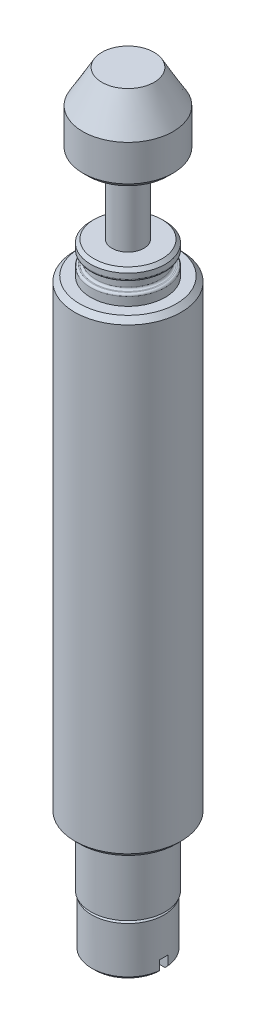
ISO-10303-21;
HEADER;
FILE_DESCRIPTION(('STEP AP214'),'2;1');
FILE_NAME('part.step','',(''),(''),'','','');
FILE_SCHEMA(('AUTOMOTIVE_DESIGN { 1 0 10303 214 1 1 1 1 }'));
ENDSEC;
DATA;
#1=APPLICATION_CONTEXT('core data for automotive mechanical design processes');
#2=APPLICATION_PROTOCOL_DEFINITION('international standard','automotive_design',2000,#1);
#3=PRODUCT_CONTEXT('',#1,'mechanical');
#4=PRODUCT('Part','Part','',(#3));
#5=PRODUCT_RELATED_PRODUCT_CATEGORY('part','',(#4));
#6=PRODUCT_DEFINITION_FORMATION('','',#4);
#7=PRODUCT_DEFINITION_CONTEXT('part definition',#1,'design');
#8=PRODUCT_DEFINITION('design','',#6,#7);
#9=PRODUCT_DEFINITION_SHAPE('','',#8);
#10=(LENGTH_UNIT() NAMED_UNIT(*) SI_UNIT(.MILLI.,.METRE.));
#11=(NAMED_UNIT(*) PLANE_ANGLE_UNIT() SI_UNIT($,.RADIAN.));
#12=(NAMED_UNIT(*) SI_UNIT($,.STERADIAN.) SOLID_ANGLE_UNIT());
#13=UNCERTAINTY_MEASURE_WITH_UNIT(LENGTH_MEASURE(1.E-05),#10,'distance_accuracy_value','');
#14=(GEOMETRIC_REPRESENTATION_CONTEXT(3) GLOBAL_UNCERTAINTY_ASSIGNED_CONTEXT((#13)) GLOBAL_UNIT_ASSIGNED_CONTEXT((#10,
#11,#12)) REPRESENTATION_CONTEXT('',''));
#15=CARTESIAN_POINT('',(0.,0.,0.));
#16=DIRECTION('',(0.,0.,1.));
#17=DIRECTION('',(1.,0.,0.));
#18=AXIS2_PLACEMENT_3D('',#15,#16,#17);
#19=CARTESIAN_POINT('',(0.,72.,0.));
#20=DIRECTION('',(0.,-1.,0.));
#21=DIRECTION('',(0.,0.,-1.));
#22=AXIS2_PLACEMENT_3D('',#19,#20,#21);
#23=PLANE('',#22);
#24=CARTESIAN_POINT('',(0.,72.0000000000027,0.));
#25=DIRECTION('',(0.,-1.,0.));
#26=DIRECTION('',(0.,0.,-1.));
#27=AXIS2_PLACEMENT_3D('',#24,#25,#26);
#28=CIRCLE('',#27,2.45379918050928);
#29=CARTESIAN_POINT('',(0.,72.0000000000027,-2.45379918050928));
#30=VERTEX_POINT('',#29);
#31=EDGE_CURVE('E640',#30,#30,#28,.T.);
#32=ORIENTED_EDGE('',*,*,#31,.F.);
#33=EDGE_LOOP('',(#32));
#34=FACE_BOUND('',#33,.T.);
#35=ADVANCED_FACE('F17',(#34),#23,.F.);
#36=CARTESIAN_POINT('',(0.,68.888888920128,0.));
#37=DIRECTION('',(0.,-1.,0.));
#38=DIRECTION('',(0.,0.,-1.));
#39=AXIS2_PLACEMENT_3D('',#36,#37,#38);
#40=CONICAL_SURFACE('',#39,4.24999999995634,0.523598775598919);
#41=CARTESIAN_POINT('',(0.,68.88888892,0.));
#42=DIRECTION('',(0.,1.,0.));
#43=DIRECTION('',(0.,0.,1.));
#44=AXIS2_PLACEMENT_3D('',#41,#42,#43);
#45=CIRCLE('',#44,4.25);
#46=CARTESIAN_POINT('',(0.,68.88888892,4.25));
#47=VERTEX_POINT('',#46);
#48=EDGE_CURVE('E637',#47,#47,#45,.F.);
#49=ORIENTED_EDGE('',*,*,#48,.F.);
#50=EDGE_LOOP('',(#49));
#51=FACE_BOUND('',#50,.T.);
#52=ORIENTED_EDGE('',*,*,#31,.T.);
#53=EDGE_LOOP('',(#52));
#54=FACE_BOUND('',#53,.T.);
#55=ADVANCED_FACE('F938',(#51,#54),#40,.T.);
#56=CARTESIAN_POINT('',(0.,0.,0.));
#57=DIRECTION('',(0.,1.,0.));
#58=DIRECTION('',(0.,0.,1.));
#59=AXIS2_PLACEMENT_3D('',#56,#57,#58);
#60=CYLINDRICAL_SURFACE('',#59,4.25);
#61=ORIENTED_EDGE('',*,*,#48,.T.);
#62=EDGE_LOOP('',(#61));
#63=FACE_BOUND('',#62,.T.);
#64=CARTESIAN_POINT('',(0.,65.4999999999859,0.));
#65=DIRECTION('',(0.,1.,0.));
#66=DIRECTION('',(0.,0.,1.));
#67=AXIS2_PLACEMENT_3D('',#64,#65,#66);
#68=CIRCLE('',#67,4.25000000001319);
#69=CARTESIAN_POINT('',(0.,65.4999999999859,4.25000000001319));
#70=VERTEX_POINT('',#69);
#71=EDGE_CURVE('E633',#70,#70,#68,.F.);
#72=ORIENTED_EDGE('',*,*,#71,.F.);
#73=EDGE_LOOP('',(#72));
#74=FACE_BOUND('',#73,.T.);
#75=ADVANCED_FACE('F928',(#63,#74),#60,.T.);
#76=CARTESIAN_POINT('',(0.,65.4999999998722,0.));
#77=DIRECTION('',(0.,1.,0.));
#78=DIRECTION('',(0.,0.,1.));
#79=AXIS2_PLACEMENT_3D('',#76,#77,#78);
#80=CONICAL_SURFACE('',#79,4.24999999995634,0.785398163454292);
#81=ORIENTED_EDGE('',*,*,#71,.T.);
#82=EDGE_LOOP('',(#81));
#83=FACE_BOUND('',#82,.T.);
#84=CARTESIAN_POINT('',(0.,64.9999999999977,0.));
#85=DIRECTION('',(0.,1.,0.));
#86=DIRECTION('',(0.,0.,1.));
#87=AXIS2_PLACEMENT_3D('',#84,#85,#86);
#88=CIRCLE('',#87,3.75000000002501);
#89=CARTESIAN_POINT('',(0.,64.9999999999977,3.75000000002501));
#90=VERTEX_POINT('',#89);
#91=EDGE_CURVE('E636',#90,#90,#88,.T.);
#92=ORIENTED_EDGE('',*,*,#91,.T.);
#93=EDGE_LOOP('',(#92));
#94=FACE_BOUND('',#93,.T.);
#95=ADVANCED_FACE('F918',(#83,#94),#80,.T.);
#96=CARTESIAN_POINT('',(3.75,65.,0.));
#97=DIRECTION('',(0.,1.,0.));
#98=DIRECTION('',(0.,0.,1.));
#99=AXIS2_PLACEMENT_3D('',#96,#97,#98);
#100=PLANE('',#99);
#101=CARTESIAN_POINT('',(0.,65.,0.));
#102=DIRECTION('',(0.,1.,0.));
#103=DIRECTION('',(0.,0.,1.));
#104=AXIS2_PLACEMENT_3D('',#101,#102,#103);
#105=CIRCLE('',#104,1.5);
#106=CARTESIAN_POINT('',(0.,65.,1.5));
#107=VERTEX_POINT('',#106);
#108=EDGE_CURVE('E294',#107,#107,#105,.F.);
#109=ORIENTED_EDGE('',*,*,#108,.F.);
#110=EDGE_LOOP('',(#109));
#111=FACE_BOUND('',#110,.T.);
#112=ORIENTED_EDGE('',*,*,#91,.F.);
#113=EDGE_LOOP('',(#112));
#114=FACE_BOUND('',#113,.T.);
#115=ADVANCED_FACE('F908',(#111,#114),#100,.F.);
#116=CARTESIAN_POINT('',(0.,2.5,0.));
#117=DIRECTION('',(0.,1.,0.));
#118=DIRECTION('',(0.,0.,1.));
#119=AXIS2_PLACEMENT_3D('',#116,#117,#118);
#120=PLANE('',#119);
#121=DIRECTION('',(0.866025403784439,0.,-0.5));
#122=VECTOR('',#121,1.);
#123=CARTESIAN_POINT('',(0.,2.5,-0.75));
#124=LINE('',#123,#122);
#125=CARTESIAN_POINT('',(0.,2.5,-0.75));
#126=VERTEX_POINT('',#125);
#127=CARTESIAN_POINT('',(-0.649519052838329,2.5,-0.375));
#128=VERTEX_POINT('',#127);
#129=EDGE_CURVE('E599',#126,#128,#124,.F.);
#130=ORIENTED_EDGE('',*,*,#129,.F.);
#131=DIRECTION('',(0.866025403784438,0.,0.5));
#132=VECTOR('',#131,1.);
#133=CARTESIAN_POINT('',(0.64951905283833,2.5,-0.374999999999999));
#134=LINE('',#133,#132);
#135=CARTESIAN_POINT('',(0.649519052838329,2.5,-0.375));
#136=VERTEX_POINT('',#135);
#137=EDGE_CURVE('E604',#136,#126,#134,.F.);
#138=ORIENTED_EDGE('',*,*,#137,.F.);
#139=DIRECTION('',(0.,0.,1.));
#140=VECTOR('',#139,1.);
#141=CARTESIAN_POINT('',(0.649519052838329,2.5,0.375));
#142=LINE('',#141,#140);
#143=CARTESIAN_POINT('',(0.649519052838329,2.5,0.375));
#144=VERTEX_POINT('',#143);
#145=EDGE_CURVE('E578',#144,#136,#142,.F.);
#146=ORIENTED_EDGE('',*,*,#145,.F.);
#147=DIRECTION('',(-0.866025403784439,0.,0.5));
#148=VECTOR('',#147,1.);
#149=CARTESIAN_POINT('',(0.,2.5,0.75));
#150=LINE('',#149,#148);
#151=CARTESIAN_POINT('',(0.,2.5,0.75));
#152=VERTEX_POINT('',#151);
#153=EDGE_CURVE('E584',#152,#144,#150,.F.);
#154=ORIENTED_EDGE('',*,*,#153,.F.);
#155=DIRECTION('',(-0.866025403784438,0.,-0.5));
#156=VECTOR('',#155,1.);
#157=CARTESIAN_POINT('',(-0.64951905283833,2.5,0.374999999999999));
#158=LINE('',#157,#156);
#159=CARTESIAN_POINT('',(-0.649519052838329,2.5,0.374999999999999));
#160=VERTEX_POINT('',#159);
#161=EDGE_CURVE('E589',#160,#152,#158,.F.);
#162=ORIENTED_EDGE('',*,*,#161,.F.);
#163=DIRECTION('',(0.,0.,-1.));
#164=VECTOR('',#163,1.);
#165=CARTESIAN_POINT('',(-0.649519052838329,2.5,-0.375));
#166=LINE('',#165,#164);
#167=EDGE_CURVE('E594',#128,#160,#166,.F.);
#168=ORIENTED_EDGE('',*,*,#167,.F.);
#169=EDGE_LOOP('',(#130,#138,#146,#154,#162,#168));
#170=FACE_BOUND('',#169,.T.);
#171=ADVANCED_FACE('F897',(#170),#120,.F.);
#172=CARTESIAN_POINT('',(0.,0.,0.));
#173=DIRECTION('',(0.,1.,0.));
#174=DIRECTION('',(0.,0.,1.));
#175=AXIS2_PLACEMENT_3D('',#172,#173,#174);
#176=CYLINDRICAL_SURFACE('',#175,1.5);
#177=ORIENTED_EDGE('',*,*,#108,.T.);
#178=EDGE_LOOP('',(#177));
#179=FACE_BOUND('',#178,.T.);
#180=CARTESIAN_POINT('',(0.,58.,0.));
#181=DIRECTION('',(0.,1.,0.));
#182=DIRECTION('',(0.,0.,1.));
#183=AXIS2_PLACEMENT_3D('',#180,#181,#182);
#184=CIRCLE('',#183,1.5);
#185=CARTESIAN_POINT('',(0.,58.,1.5));
#186=VERTEX_POINT('',#185);
#187=EDGE_CURVE('E222',#186,#186,#184,.T.);
#188=ORIENTED_EDGE('',*,*,#187,.T.);
#189=EDGE_LOOP('',(#188));
#190=FACE_BOUND('',#189,.T.);
#191=ADVANCED_FACE('F886',(#179,#190),#176,.T.);
#192=CARTESIAN_POINT('',(0.64951905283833,2.5,-0.374999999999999));
#193=DIRECTION('',(-0.5,0.,0.866025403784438));
#194=DIRECTION('',(0.866025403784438,0.,0.5));
#195=AXIS2_PLACEMENT_3D('',#192,#193,#194);
#196=PLANE('',#195);
#197=DIRECTION('',(0.,1.,0.));
#198=VECTOR('',#197,1.);
#199=CARTESIAN_POINT('',(0.,2.5,-0.75));
#200=LINE('',#199,#198);
#201=CARTESIAN_POINT('',(0.,1.20000000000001,-0.75));
#202=VERTEX_POINT('',#201);
#203=EDGE_CURVE('E601',#202,#126,#200,.T.);
#204=ORIENTED_EDGE('',*,*,#203,.F.);
#205=DIRECTION('',(-0.866025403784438,0.,-0.5));
#206=VECTOR('',#205,1.);
#207=CARTESIAN_POINT('',(0.64951905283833,1.2,-0.374999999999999));
#208=LINE('',#207,#206);
#209=CARTESIAN_POINT('',(0.649519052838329,1.20000000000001,-0.375));
#210=VERTEX_POINT('',#209);
#211=EDGE_CURVE('E225',#210,#202,#208,.T.);
#212=ORIENTED_EDGE('',*,*,#211,.F.);
#213=DIRECTION('',(0.,1.,0.));
#214=VECTOR('',#213,1.);
#215=CARTESIAN_POINT('',(0.649519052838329,2.5,-0.374999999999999));
#216=LINE('',#215,#214);
#217=EDGE_CURVE('E575',#136,#210,#216,.F.);
#218=ORIENTED_EDGE('',*,*,#217,.F.);
#219=ORIENTED_EDGE('',*,*,#137,.T.);
#220=EDGE_LOOP('',(#204,#212,#218,#219));
#221=FACE_BOUND('',#220,.T.);
#222=ADVANCED_FACE('F876',(#221),#196,.T.);
#223=CARTESIAN_POINT('',(0.,2.5,-0.75));
#224=DIRECTION('',(0.5,0.,0.866025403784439));
#225=DIRECTION('',(0.866025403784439,0.,-0.5));
#226=AXIS2_PLACEMENT_3D('',#223,#224,#225);
#227=PLANE('',#226);
#228=DIRECTION('',(0.,1.,0.));
#229=VECTOR('',#228,1.);
#230=CARTESIAN_POINT('',(-0.649519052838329,2.5,-0.375));
#231=LINE('',#230,#229);
#232=CARTESIAN_POINT('',(-0.649519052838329,1.20000000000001,-0.375));
#233=VERTEX_POINT('',#232);
#234=EDGE_CURVE('E596',#233,#128,#231,.T.);
#235=ORIENTED_EDGE('',*,*,#234,.F.);
#236=DIRECTION('',(-0.866025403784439,0.,0.5));
#237=VECTOR('',#236,1.);
#238=CARTESIAN_POINT('',(0.,1.20000000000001,-0.75));
#239=LINE('',#238,#237);
#240=EDGE_CURVE('E561',#202,#233,#239,.T.);
#241=ORIENTED_EDGE('',*,*,#240,.F.);
#242=ORIENTED_EDGE('',*,*,#203,.T.);
#243=ORIENTED_EDGE('',*,*,#129,.T.);
#244=EDGE_LOOP('',(#235,#241,#242,#243));
#245=FACE_BOUND('',#244,.T.);
#246=ADVANCED_FACE('F866',(#245),#227,.T.);
#247=CARTESIAN_POINT('',(-0.649519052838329,2.5,-0.375));
#248=DIRECTION('',(1.,0.,0.));
#249=DIRECTION('',(0.,0.,-1.));
#250=AXIS2_PLACEMENT_3D('',#247,#248,#249);
#251=PLANE('',#250);
#252=DIRECTION('',(0.,1.,0.));
#253=VECTOR('',#252,1.);
#254=CARTESIAN_POINT('',(-0.64951905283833,2.5,0.374999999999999));
#255=LINE('',#254,#253);
#256=CARTESIAN_POINT('',(-0.649519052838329,1.20000000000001,0.374999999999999));
#257=VERTEX_POINT('',#256);
#258=EDGE_CURVE('E591',#257,#160,#255,.T.);
#259=ORIENTED_EDGE('',*,*,#258,.F.);
#260=DIRECTION('',(0.,0.,1.));
#261=VECTOR('',#260,1.);
#262=CARTESIAN_POINT('',(-0.649519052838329,1.20000000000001,0.));
#263=LINE('',#262,#261);
#264=EDGE_CURVE('E558',#233,#257,#263,.T.);
#265=ORIENTED_EDGE('',*,*,#264,.F.);
#266=ORIENTED_EDGE('',*,*,#234,.T.);
#267=ORIENTED_EDGE('',*,*,#167,.T.);
#268=EDGE_LOOP('',(#259,#265,#266,#267));
#269=FACE_BOUND('',#268,.T.);
#270=ADVANCED_FACE('F856',(#269),#251,.T.);
#271=CARTESIAN_POINT('',(-0.64951905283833,2.5,0.374999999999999));
#272=DIRECTION('',(0.5,0.,-0.866025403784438));
#273=DIRECTION('',(-0.866025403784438,0.,-0.5));
#274=AXIS2_PLACEMENT_3D('',#271,#272,#273);
#275=PLANE('',#274);
#276=DIRECTION('',(0.,1.,0.));
#277=VECTOR('',#276,1.);
#278=CARTESIAN_POINT('',(0.,2.5,0.75));
#279=LINE('',#278,#277);
#280=CARTESIAN_POINT('',(0.,1.2,0.75));
#281=VERTEX_POINT('',#280);
#282=EDGE_CURVE('E586',#281,#152,#279,.T.);
#283=ORIENTED_EDGE('',*,*,#282,.F.);
#284=DIRECTION('',(0.866025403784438,0.,0.5));
#285=VECTOR('',#284,1.);
#286=CARTESIAN_POINT('',(-0.64951905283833,1.20000000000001,0.374999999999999));
#287=LINE('',#286,#285);
#288=EDGE_CURVE('E555',#257,#281,#287,.T.);
#289=ORIENTED_EDGE('',*,*,#288,.F.);
#290=ORIENTED_EDGE('',*,*,#258,.T.);
#291=ORIENTED_EDGE('',*,*,#161,.T.);
#292=EDGE_LOOP('',(#283,#289,#290,#291));
#293=FACE_BOUND('',#292,.T.);
#294=ADVANCED_FACE('F847',(#293),#275,.T.);
#295=CARTESIAN_POINT('',(0.,2.5,0.75));
#296=DIRECTION('',(-0.5,0.,-0.866025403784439));
#297=DIRECTION('',(-0.866025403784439,0.,0.5));
#298=AXIS2_PLACEMENT_3D('',#295,#296,#297);
#299=PLANE('',#298);
#300=DIRECTION('',(0.,1.,0.));
#301=VECTOR('',#300,1.);
#302=CARTESIAN_POINT('',(0.649519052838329,2.5,0.375));
#303=LINE('',#302,#301);
#304=CARTESIAN_POINT('',(0.649519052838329,1.2,0.375));
#305=VERTEX_POINT('',#304);
#306=EDGE_CURVE('E581',#305,#144,#303,.T.);
#307=ORIENTED_EDGE('',*,*,#306,.F.);
#308=DIRECTION('',(0.866025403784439,0.,-0.5));
#309=VECTOR('',#308,1.);
#310=CARTESIAN_POINT('',(0.,1.20000000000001,0.75));
#311=LINE('',#310,#309);
#312=EDGE_CURVE('E552',#281,#305,#311,.T.);
#313=ORIENTED_EDGE('',*,*,#312,.F.);
#314=ORIENTED_EDGE('',*,*,#282,.T.);
#315=ORIENTED_EDGE('',*,*,#153,.T.);
#316=EDGE_LOOP('',(#307,#313,#314,#315));
#317=FACE_BOUND('',#316,.T.);
#318=ADVANCED_FACE('F838',(#317),#299,.T.);
#319=CARTESIAN_POINT('',(0.649519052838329,2.5,0.375));
#320=DIRECTION('',(-1.,0.,0.));
#321=DIRECTION('',(0.,0.,1.));
#322=AXIS2_PLACEMENT_3D('',#319,#320,#321);
#323=PLANE('',#322);
#324=ORIENTED_EDGE('',*,*,#217,.T.);
#325=DIRECTION('',(0.,0.,1.));
#326=VECTOR('',#325,1.);
#327=CARTESIAN_POINT('',(0.649519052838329,1.2,0.));
#328=LINE('',#327,#326);
#329=EDGE_CURVE('E199',#305,#210,#328,.F.);
#330=ORIENTED_EDGE('',*,*,#329,.F.);
#331=ORIENTED_EDGE('',*,*,#306,.T.);
#332=ORIENTED_EDGE('',*,*,#145,.T.);
#333=EDGE_LOOP('',(#324,#330,#331,#332));
#334=FACE_BOUND('',#333,.T.);
#335=ADVANCED_FACE('F285',(#334),#323,.T.);
#336=CARTESIAN_POINT('',(0.,0.,-0.4));
#337=DIRECTION('',(0.,0.,1.));
#338=DIRECTION('',(1.,0.,0.));
#339=AXIS2_PLACEMENT_3D('',#336,#337,#338);
#340=PLANE('',#339);
#341=DIRECTION('',(1.,0.,0.));
#342=VECTOR('',#341,1.);
#343=CARTESIAN_POINT('',(0.,0.,-0.4));
#344=LINE('',#343,#342);
#345=CARTESIAN_POINT('',(1.44568322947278,2.84261503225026E-11,-0.4));
#346=VERTEX_POINT('',#345);
#347=CARTESIAN_POINT('',(3.07408522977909,-8.32018009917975E-11,-0.4));
#348=VERTEX_POINT('',#347);
#349=EDGE_CURVE('E268',#346,#348,#344,.T.);
#350=ORIENTED_EDGE('',*,*,#349,.T.);
#351=CARTESIAN_POINT('',(3.07408522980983,-5.27169135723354E-11,-0.4));
#352=CARTESIAN_POINT('',(3.12448691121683,0.0499820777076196,-0.4));
#353=CARTESIAN_POINT('',(3.17487969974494,0.0999731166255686,-0.4));
#354=CARTESIAN_POINT('',(3.2756474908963,0.199973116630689,-0.4));
#355=CARTESIAN_POINT('',(3.32602249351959,0.249982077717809,-0.4));
#356=CARTESIAN_POINT('',(3.37638860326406,0.299999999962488,-0.4));
#357=B_SPLINE_CURVE_WITH_KNOTS('',3,(#351,#352,#353,#354,#355,#356),.UNSPECIFIED.,.F.,.F.,(4,2,
4),(0.,0.212947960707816,0.425895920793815),.UNSPECIFIED.);
#358=CARTESIAN_POINT('',(3.37638860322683,0.299999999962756,-0.4));
#359=VERTEX_POINT('',#358);
#360=EDGE_CURVE('E260',#348,#359,#357,.T.);
#361=ORIENTED_EDGE('',*,*,#360,.T.);
#362=DIRECTION('',(0.,1.,0.));
#363=VECTOR('',#362,1.);
#364=CARTESIAN_POINT('',(3.37638860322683,0.,-0.4));
#365=LINE('',#364,#363);
#366=CARTESIAN_POINT('',(3.37638860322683,1.19999999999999,-0.4));
#367=VERTEX_POINT('',#366);
#368=EDGE_CURVE('E188',#359,#367,#365,.T.);
#369=ORIENTED_EDGE('',*,*,#368,.T.);
#370=DIRECTION('',(1.,0.,0.));
#371=VECTOR('',#370,1.);
#372=CARTESIAN_POINT('',(0.,1.20000000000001,-0.4));
#373=LINE('',#372,#371);
#374=CARTESIAN_POINT('',(1.44568322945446,1.19999999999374,-0.4));
#375=VERTEX_POINT('',#374);
#376=EDGE_CURVE('E191',#375,#367,#373,.T.);
#377=ORIENTED_EDGE('',*,*,#376,.F.);
#378=CARTESIAN_POINT('',(1.44568322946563,1.20000000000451,-0.4));
#379=CARTESIAN_POINT('',(1.39871719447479,1.15469460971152,-0.4));
#380=CARTESIAN_POINT('',(1.35164504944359,1.10950026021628,-0.4));
#381=CARTESIAN_POINT('',(1.25728848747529,1.01933359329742,-0.4));
#382=CARTESIAN_POINT('',(1.21000407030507,0.974361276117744,-0.4));
#383=CARTESIAN_POINT('',(1.16261354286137,0.929499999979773,-0.4));
#384=B_SPLINE_CURVE_WITH_KNOTS('',3,(#378,#379,#380,#381,#382,#383),.UNSPECIFIED.,.F.,.F.,(4,2,
4),(0.,0.195767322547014,0.391534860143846),.UNSPECIFIED.);
#385=CARTESIAN_POINT('',(1.16261354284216,0.929499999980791,-0.4));
#386=VERTEX_POINT('',#385);
#387=EDGE_CURVE('E178',#375,#386,#384,.T.);
#388=ORIENTED_EDGE('',*,*,#387,.T.);
#389=DIRECTION('',(0.,1.,0.));
#390=VECTOR('',#389,1.);
#391=CARTESIAN_POINT('',(1.16261354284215,0.,-0.4));
#392=LINE('',#391,#390);
#393=CARTESIAN_POINT('',(1.16261354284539,0.270500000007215,-0.4));
#394=VERTEX_POINT('',#393);
#395=EDGE_CURVE('E187',#386,#394,#392,.F.);
#396=ORIENTED_EDGE('',*,*,#395,.T.);
#397=CARTESIAN_POINT('',(1.16261354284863,0.270500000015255,-0.4));
#398=CARTESIAN_POINT('',(1.21000407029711,0.225638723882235,-0.4));
#399=CARTESIAN_POINT('',(1.2572884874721,0.180666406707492,-0.4));
#400=CARTESIAN_POINT('',(1.35164504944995,0.0904997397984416,-0.4));
#401=CARTESIAN_POINT('',(1.39871719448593,0.0453053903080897,-0.4));
#402=CARTESIAN_POINT('',(1.44568322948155,1.99714614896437E-11,-0.4));
#403=B_SPLINE_CURVE_WITH_KNOTS('',3,(#397,#398,#399,#400,#401,#402),.UNSPECIFIED.,.F.,.F.,(4,2,
4),(0.,0.195767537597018,0.391534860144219),.UNSPECIFIED.);
#404=EDGE_CURVE('E276',#394,#346,#403,.T.);
#405=ORIENTED_EDGE('',*,*,#404,.T.);
#406=EDGE_LOOP('',(#350,#361,#369,#377,#388,#396,#405));
#407=FACE_BOUND('',#406,.T.);
#408=ADVANCED_FACE('F193',(#407),#340,.T.);
#409=CARTESIAN_POINT('',(0.,0.,0.4));
#410=DIRECTION('',(0.,0.,1.));
#411=DIRECTION('',(1.,0.,0.));
#412=AXIS2_PLACEMENT_3D('',#409,#410,#411);
#413=PLANE('',#412);
#414=DIRECTION('',(1.,0.,0.));
#415=VECTOR('',#414,1.);
#416=CARTESIAN_POINT('',(0.,0.,0.4));
#417=LINE('',#416,#415);
#418=CARTESIAN_POINT('',(1.44568322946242,3.84122516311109E-11,0.4));
#419=VERTEX_POINT('',#418);
#420=CARTESIAN_POINT('',(3.07408522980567,-5.68432580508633E-11,0.4));
#421=VERTEX_POINT('',#420);
#422=EDGE_CURVE('E626',#419,#421,#417,.T.);
#423=ORIENTED_EDGE('',*,*,#422,.F.);
#424=CARTESIAN_POINT('',(1.16261354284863,0.270500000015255,0.4));
#425=CARTESIAN_POINT('',(1.21000407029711,0.225638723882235,0.4));
#426=CARTESIAN_POINT('',(1.2572884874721,0.180666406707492,0.4));
#427=CARTESIAN_POINT('',(1.35164504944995,0.0904997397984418,0.4));
#428=CARTESIAN_POINT('',(1.39871719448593,0.04530539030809,0.4));
#429=CARTESIAN_POINT('',(1.44568322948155,1.99718829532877E-11,0.4));
#430=B_SPLINE_CURVE_WITH_KNOTS('',3,(#424,#425,#426,#427,#428,#429),.UNSPECIFIED.,.F.,.F.,(4,2,
4),(0.,0.195767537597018,0.391534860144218),.UNSPECIFIED.);
#431=CARTESIAN_POINT('',(1.16261354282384,0.270500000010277,0.4));
#432=VERTEX_POINT('',#431);
#433=EDGE_CURVE('E628',#432,#419,#430,.T.);
#434=ORIENTED_EDGE('',*,*,#433,.F.);
#435=DIRECTION('',(0.,1.,0.));
#436=VECTOR('',#435,1.);
#437=CARTESIAN_POINT('',(1.16261354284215,0.,0.4));
#438=LINE('',#437,#436);
#439=CARTESIAN_POINT('',(1.16261354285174,0.929499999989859,0.4));
#440=VERTEX_POINT('',#439);
#441=EDGE_CURVE('E629',#440,#432,#438,.F.);
#442=ORIENTED_EDGE('',*,*,#441,.F.);
#443=CARTESIAN_POINT('',(1.44568322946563,1.20000000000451,0.4));
#444=CARTESIAN_POINT('',(1.39871719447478,1.15469460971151,0.4));
#445=CARTESIAN_POINT('',(1.35164504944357,1.10950026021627,0.4));
#446=CARTESIAN_POINT('',(1.25728848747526,1.01933359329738,0.4));
#447=CARTESIAN_POINT('',(1.21000407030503,0.974361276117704,0.4));
#448=CARTESIAN_POINT('',(1.16261354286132,0.929499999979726,0.4));
#449=B_SPLINE_CURVE_WITH_KNOTS('',3,(#443,#444,#445,#446,#447,#448),.UNSPECIFIED.,.F.,.F.,(4,2,
4),(0.,0.195767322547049,0.391534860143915),.UNSPECIFIED.);
#450=CARTESIAN_POINT('',(1.44568322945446,1.19999999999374,0.4));
#451=VERTEX_POINT('',#450);
#452=EDGE_CURVE('E269',#451,#440,#449,.T.);
#453=ORIENTED_EDGE('',*,*,#452,.F.);
#454=DIRECTION('',(1.,0.,0.));
#455=VECTOR('',#454,1.);
#456=CARTESIAN_POINT('',(0.,1.20000000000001,0.4));
#457=LINE('',#456,#455);
#458=CARTESIAN_POINT('',(3.37638860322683,1.19999999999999,0.4));
#459=VERTEX_POINT('',#458);
#460=EDGE_CURVE('E221',#459,#451,#457,.F.);
#461=ORIENTED_EDGE('',*,*,#460,.F.);
#462=DIRECTION('',(0.,1.,0.));
#463=VECTOR('',#462,1.);
#464=CARTESIAN_POINT('',(3.37638860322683,0.,0.4));
#465=LINE('',#464,#463);
#466=CARTESIAN_POINT('',(3.37638860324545,0.299999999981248,0.4));
#467=VERTEX_POINT('',#466);
#468=EDGE_CURVE('E267',#467,#459,#465,.T.);
#469=ORIENTED_EDGE('',*,*,#468,.F.);
#470=CARTESIAN_POINT('',(3.07408522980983,-5.27163483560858E-11,0.4));
#471=CARTESIAN_POINT('',(3.12448691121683,0.0499820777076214,0.4));
#472=CARTESIAN_POINT('',(3.17487969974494,0.0999731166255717,0.4));
#473=CARTESIAN_POINT('',(3.27564749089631,0.199973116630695,0.4));
#474=CARTESIAN_POINT('',(3.3260224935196,0.249982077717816,0.4));
#475=CARTESIAN_POINT('',(3.37638860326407,0.299999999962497,0.4));
#476=B_SPLINE_CURVE_WITH_KNOTS('',3,(#470,#471,#472,#473,#474,#475),.UNSPECIFIED.,.F.,.F.,(4,2,
4),(0.,0.212947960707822,0.425895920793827),.UNSPECIFIED.);
#477=EDGE_CURVE('E619',#421,#467,#476,.T.);
#478=ORIENTED_EDGE('',*,*,#477,.F.);
#479=EDGE_LOOP('',(#423,#434,#442,#453,#461,#469,#478));
#480=FACE_BOUND('',#479,.T.);
#481=ADVANCED_FACE('F284',(#480),#413,.F.);
#482=CARTESIAN_POINT('',(0.,0.,0.4));
#483=DIRECTION('',(0.,0.,1.));
#484=DIRECTION('',(1.,0.,0.));
#485=AXIS2_PLACEMENT_3D('',#482,#483,#484);
#486=PLANE('',#485);
#487=DIRECTION('',(0.,1.,0.));
#488=VECTOR('',#487,1.);
#489=CARTESIAN_POINT('',(-3.37638860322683,0.,0.4));
#490=LINE('',#489,#488);
#491=CARTESIAN_POINT('',(-3.37638860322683,1.20000000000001,0.4));
#492=VERTEX_POINT('',#491);
#493=CARTESIAN_POINT('',(-3.37638860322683,0.299999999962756,0.4));
#494=VERTEX_POINT('',#493);
#495=EDGE_CURVE('E568',#492,#494,#490,.F.);
#496=ORIENTED_EDGE('',*,*,#495,.F.);
#497=DIRECTION('',(1.,0.,0.));
#498=VECTOR('',#497,1.);
#499=CARTESIAN_POINT('',(0.,1.20000000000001,0.4));
#500=LINE('',#499,#498);
#501=CARTESIAN_POINT('',(-1.44568322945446,1.19999999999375,0.4));
#502=VERTEX_POINT('',#501);
#503=EDGE_CURVE('E219',#502,#492,#500,.F.);
#504=ORIENTED_EDGE('',*,*,#503,.F.);
#505=CARTESIAN_POINT('',(-1.16261354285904,0.929499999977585,0.4));
#506=CARTESIAN_POINT('',(-1.21000407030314,0.974361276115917,0.4));
#507=CARTESIAN_POINT('',(-1.25728848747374,1.01933359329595,0.4));
#508=CARTESIAN_POINT('',(-1.35164504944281,1.10950026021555,0.4));
#509=CARTESIAN_POINT('',(-1.3987171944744,1.15469460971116,0.4));
#510=CARTESIAN_POINT('',(-1.44568322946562,1.20000000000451,0.4));
#511=B_SPLINE_CURVE_WITH_KNOTS('',3,(#505,#506,#507,#508,#509,#510),.UNSPECIFIED.,.F.,.F.,(4,2,
4),(0.,0.195767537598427,0.391534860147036),.UNSPECIFIED.);
#512=CARTESIAN_POINT('',(-1.16261354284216,0.929499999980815,0.4));
#513=VERTEX_POINT('',#512);
#514=EDGE_CURVE('E572',#513,#502,#511,.T.);
#515=ORIENTED_EDGE('',*,*,#514,.F.);
#516=DIRECTION('',(0.,1.,0.));
#517=VECTOR('',#516,1.);
#518=CARTESIAN_POINT('',(-1.16261354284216,0.,0.4));
#519=LINE('',#518,#517);
#520=CARTESIAN_POINT('',(-1.16261354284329,0.270500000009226,0.4));
#521=VERTEX_POINT('',#520);
#522=EDGE_CURVE('E622',#521,#513,#519,.T.);
#523=ORIENTED_EDGE('',*,*,#522,.F.);
#524=CARTESIAN_POINT('',(-1.44568322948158,1.99746999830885E-11,0.4));
#525=CARTESIAN_POINT('',(-1.39871719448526,0.0453053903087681,0.4));
#526=CARTESIAN_POINT('',(-1.35164504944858,0.0904997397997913,0.4));
#527=CARTESIAN_POINT('',(-1.25728848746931,0.180666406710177,0.4));
#528=CARTESIAN_POINT('',(-1.21000407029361,0.225638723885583,0.4));
#529=CARTESIAN_POINT('',(-1.16261354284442,0.270500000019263,0.4));
#530=B_SPLINE_CURVE_WITH_KNOTS('',3,(#524,#525,#526,#527,#528,#529),.UNSPECIFIED.,.F.,.F.,(4,2,
4),(0.,0.195767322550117,0.391534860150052),.UNSPECIFIED.);
#531=CARTESIAN_POINT('',(-1.44568322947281,2.84305388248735E-11,0.4));
#532=VERTEX_POINT('',#531);
#533=EDGE_CURVE('E618',#532,#521,#530,.T.);
#534=ORIENTED_EDGE('',*,*,#533,.F.);
#535=DIRECTION('',(1.,0.,0.));
#536=VECTOR('',#535,1.);
#537=CARTESIAN_POINT('',(0.,0.,0.4));
#538=LINE('',#537,#536);
#539=CARTESIAN_POINT('',(-3.07408522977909,-8.3201803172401E-11,0.4));
#540=VERTEX_POINT('',#539);
#541=EDGE_CURVE('E616',#540,#532,#538,.T.);
#542=ORIENTED_EDGE('',*,*,#541,.F.);
#543=CARTESIAN_POINT('',(-3.37638860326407,0.299999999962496,0.4));
#544=CARTESIAN_POINT('',(-3.3260224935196,0.249982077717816,0.4));
#545=CARTESIAN_POINT('',(-3.2756474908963,0.199973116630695,0.4));
#546=CARTESIAN_POINT('',(-3.17487969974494,0.0999731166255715,0.4));
#547=CARTESIAN_POINT('',(-3.12448691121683,0.0499820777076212,0.4));
#548=CARTESIAN_POINT('',(-3.07408522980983,-5.27165687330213E-11,0.4));
#549=B_SPLINE_CURVE_WITH_KNOTS('',3,(#543,#544,#545,#546,#547,#548),.UNSPECIFIED.,.F.,.F.,(4,2,
4),(0.,0.212947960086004,0.425895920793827),.UNSPECIFIED.);
#550=EDGE_CURVE('E571',#494,#540,#549,.T.);
#551=ORIENTED_EDGE('',*,*,#550,.F.);
#552=EDGE_LOOP('',(#496,#504,#515,#523,#534,#542,#551));
#553=FACE_BOUND('',#552,.T.);
#554=ADVANCED_FACE('F315',(#553),#486,.F.);
#555=CARTESIAN_POINT('',(0.,0.,-0.4));
#556=DIRECTION('',(0.,0.,1.));
#557=DIRECTION('',(1.,0.,0.));
#558=AXIS2_PLACEMENT_3D('',#555,#556,#557);
#559=PLANE('',#558);
#560=DIRECTION('',(0.,1.,0.));
#561=VECTOR('',#560,1.);
#562=CARTESIAN_POINT('',(-3.37638860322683,0.,-0.4));
#563=LINE('',#562,#561);
#564=CARTESIAN_POINT('',(-3.37638860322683,1.20000000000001,-0.4));
#565=VERTEX_POINT('',#564);
#566=CARTESIAN_POINT('',(-3.37638860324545,0.299999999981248,-0.4));
#567=VERTEX_POINT('',#566);
#568=EDGE_CURVE('E234',#565,#567,#563,.F.);
#569=ORIENTED_EDGE('',*,*,#568,.T.);
#570=CARTESIAN_POINT('',(-3.37638860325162,0.299999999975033,-0.399999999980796));
#571=CARTESIAN_POINT('',(-3.32602249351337,0.249982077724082,-0.399999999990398));
#572=CARTESIAN_POINT('',(-3.27564749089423,0.199973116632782,-0.399999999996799));
#573=CARTESIAN_POINT('',(-3.17487969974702,0.0999731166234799,-0.400000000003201));
#574=CARTESIAN_POINT('',(-3.1244869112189,0.0499820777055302,-0.400000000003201));
#575=CARTESIAN_POINT('',(-3.07408522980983,-5.27172000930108E-11,-0.4));
#576=B_SPLINE_CURVE_WITH_KNOTS('',3,(#570,#571,#572,#573,#574,#575),.UNSPECIFIED.,.F.,.F.,(4,2,
4),(0.,0.212947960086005,0.425895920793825),.UNSPECIFIED.);
#577=CARTESIAN_POINT('',(-3.07408522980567,-5.6843418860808E-11,-0.4));
#578=VERTEX_POINT('',#577);
#579=EDGE_CURVE('E226',#567,#578,#576,.T.);
#580=ORIENTED_EDGE('',*,*,#579,.T.);
#581=DIRECTION('',(1.,0.,0.));
#582=VECTOR('',#581,1.);
#583=CARTESIAN_POINT('',(0.,0.,-0.4));
#584=LINE('',#583,#582);
#585=CARTESIAN_POINT('',(-1.44568322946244,3.84136430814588E-11,-0.4));
#586=VERTEX_POINT('',#585);
#587=EDGE_CURVE('E606',#578,#586,#584,.T.);
#588=ORIENTED_EDGE('',*,*,#587,.T.);
#589=CARTESIAN_POINT('',(-1.44568322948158,1.99749714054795E-11,-0.4));
#590=CARTESIAN_POINT('',(-1.39871719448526,0.0453053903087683,-0.4));
#591=CARTESIAN_POINT('',(-1.35164504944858,0.0904997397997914,-0.4));
#592=CARTESIAN_POINT('',(-1.25728848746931,0.180666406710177,-0.4));
#593=CARTESIAN_POINT('',(-1.21000407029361,0.225638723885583,-0.4));
#594=CARTESIAN_POINT('',(-1.16261354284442,0.270500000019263,-0.4));
#595=B_SPLINE_CURVE_WITH_KNOTS('',3,(#589,#590,#591,#592,#593,#594),.UNSPECIFIED.,.F.,.F.,(4,2,
4),(0.,0.195767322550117,0.391534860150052),.UNSPECIFIED.);
#596=CARTESIAN_POINT('',(-1.16261354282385,0.270500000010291,-0.4));
#597=VERTEX_POINT('',#596);
#598=EDGE_CURVE('E609',#586,#597,#595,.T.);
#599=ORIENTED_EDGE('',*,*,#598,.T.);
#600=DIRECTION('',(0.,1.,0.));
#601=VECTOR('',#600,1.);
#602=CARTESIAN_POINT('',(-1.16261354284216,0.,-0.4));
#603=LINE('',#602,#601);
#604=CARTESIAN_POINT('',(-1.1626135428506,0.929499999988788,-0.4));
#605=VERTEX_POINT('',#604);
#606=EDGE_CURVE('E611',#597,#605,#603,.T.);
#607=ORIENTED_EDGE('',*,*,#606,.T.);
#608=CARTESIAN_POINT('',(-1.16261354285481,0.929499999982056,-0.399999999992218));
#609=CARTESIAN_POINT('',(-1.21000407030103,0.974361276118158,-0.399999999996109));
#610=CARTESIAN_POINT('',(-1.25728848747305,1.01933359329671,-0.399999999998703));
#611=CARTESIAN_POINT('',(-1.35164504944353,1.10950026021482,-0.400000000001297));
#612=CARTESIAN_POINT('',(-1.39871719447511,1.15469460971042,-0.400000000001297));
#613=CARTESIAN_POINT('',(-1.44568322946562,1.20000000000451,-0.4));
#614=B_SPLINE_CURVE_WITH_KNOTS('',3,(#608,#609,#610,#611,#612,#613),.UNSPECIFIED.,.F.,.F.,(4,2,
4),(0.,0.195767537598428,0.391534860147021),.UNSPECIFIED.);
#615=CARTESIAN_POINT('',(-1.44568322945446,1.19999999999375,-0.4));
#616=VERTEX_POINT('',#615);
#617=EDGE_CURVE('E235',#605,#616,#614,.T.);
#618=ORIENTED_EDGE('',*,*,#617,.T.);
#619=DIRECTION('',(1.,0.,0.));
#620=VECTOR('',#619,1.);
#621=CARTESIAN_POINT('',(0.,1.20000000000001,-0.4));
#622=LINE('',#621,#620);
#623=EDGE_CURVE('E206',#565,#616,#622,.T.);
#624=ORIENTED_EDGE('',*,*,#623,.F.);
#625=EDGE_LOOP('',(#569,#580,#588,#599,#607,#618,#624));
#626=FACE_BOUND('',#625,.T.);
#627=ADVANCED_FACE('F241',(#626),#559,.T.);
#628=CARTESIAN_POINT('',(1.5,58.,0.));
#629=DIRECTION('',(0.,-1.,0.));
#630=DIRECTION('',(0.,0.,-1.));
#631=AXIS2_PLACEMENT_3D('',#628,#629,#630);
#632=PLANE('',#631);
#633=CARTESIAN_POINT('',(0.,57.9999999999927,0.));
#634=DIRECTION('',(0.,-1.,0.));
#635=DIRECTION('',(0.,0.,-1.));
#636=AXIS2_PLACEMENT_3D('',#633,#634,#635);
#637=CIRCLE('',#636,3.19999999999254);
#638=CARTESIAN_POINT('',(0.,57.9999999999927,-3.19999999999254));
#639=VERTEX_POINT('',#638);
#640=EDGE_CURVE('E208',#639,#639,#637,.T.);
#641=ORIENTED_EDGE('',*,*,#640,.F.);
#642=EDGE_LOOP('',(#641));
#643=FACE_BOUND('',#642,.T.);
#644=ORIENTED_EDGE('',*,*,#187,.F.);
#645=EDGE_LOOP('',(#644));
#646=FACE_BOUND('',#645,.T.);
#647=ADVANCED_FACE('F308',(#643,#646),#632,.F.);
#648=CARTESIAN_POINT('',(0.,1.20000000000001,0.));
#649=DIRECTION('',(0.,-1.,0.));
#650=DIRECTION('',(1.,0.,0.));
#651=AXIS2_PLACEMENT_3D('',#648,#649,#650);
#652=PLANE('',#651);
#653=CARTESIAN_POINT('',(0.,1.2,0.));
#654=DIRECTION('',(0.,1.,0.));
#655=DIRECTION('',(0.,0.,1.));
#656=AXIS2_PLACEMENT_3D('',#653,#654,#655);
#657=CIRCLE('',#656,3.4);
#658=EDGE_CURVE('E217',#492,#565,#657,.F.);
#659=ORIENTED_EDGE('',*,*,#658,.T.);
#660=ORIENTED_EDGE('',*,*,#623,.T.);
#661=CARTESIAN_POINT('',(0.,1.19999999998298,0.));
#662=DIRECTION('',(0.,1.,0.));
#663=DIRECTION('',(-1.,0.,0.));
#664=AXIS2_PLACEMENT_3D('',#661,#662,#663);
#665=CIRCLE('',#664,1.49999999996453);
#666=EDGE_CURVE('E182',#616,#375,#665,.F.);
#667=ORIENTED_EDGE('',*,*,#666,.T.);
#668=ORIENTED_EDGE('',*,*,#376,.T.);
#669=CARTESIAN_POINT('',(0.,1.2,0.));
#670=DIRECTION('',(0.,1.,0.));
#671=DIRECTION('',(0.,0.,1.));
#672=AXIS2_PLACEMENT_3D('',#669,#670,#671);
#673=CIRCLE('',#672,3.4);
#674=EDGE_CURVE('E198',#367,#459,#673,.F.);
#675=ORIENTED_EDGE('',*,*,#674,.T.);
#676=ORIENTED_EDGE('',*,*,#460,.T.);
#677=CARTESIAN_POINT('',(0.,1.19999999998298,0.));
#678=DIRECTION('',(0.,1.,0.));
#679=DIRECTION('',(-1.,0.,0.));
#680=AXIS2_PLACEMENT_3D('',#677,#678,#679);
#681=CIRCLE('',#680,1.49999999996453);
#682=EDGE_CURVE('E207',#451,#502,#681,.F.);
#683=ORIENTED_EDGE('',*,*,#682,.T.);
#684=ORIENTED_EDGE('',*,*,#503,.T.);
#685=EDGE_LOOP('',(#659,#660,#667,#668,#675,#676,#683,#684));
#686=FACE_BOUND('',#685,.T.);
#687=ORIENTED_EDGE('',*,*,#312,.T.);
#688=ORIENTED_EDGE('',*,*,#329,.T.);
#689=ORIENTED_EDGE('',*,*,#211,.T.);
#690=ORIENTED_EDGE('',*,*,#240,.T.);
#691=ORIENTED_EDGE('',*,*,#264,.T.);
#692=ORIENTED_EDGE('',*,*,#288,.T.);
#693=EDGE_LOOP('',(#687,#688,#689,#690,#691,#692));
#694=FACE_BOUND('',#693,.T.);
#695=ADVANCED_FACE('F203',(#686,#694),#652,.T.);
#696=CARTESIAN_POINT('',(0.,57.7000000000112,0.));
#697=DIRECTION('',(0.,-1.,0.));
#698=DIRECTION('',(0.,0.,-1.));
#699=AXIS2_PLACEMENT_3D('',#696,#697,#698);
#700=CONICAL_SURFACE('',#699,3.49999999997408,0.785398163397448);
#701=CARTESIAN_POINT('',(0.,57.7,0.));
#702=DIRECTION('',(0.,1.,0.));
#703=DIRECTION('',(0.,0.,1.));
#704=AXIS2_PLACEMENT_3D('',#701,#702,#703);
#705=CIRCLE('',#704,3.5);
#706=CARTESIAN_POINT('',(0.,57.7,3.5));
#707=VERTEX_POINT('',#706);
#708=EDGE_CURVE('E211',#707,#707,#705,.F.);
#709=ORIENTED_EDGE('',*,*,#708,.F.);
#710=EDGE_LOOP('',(#709));
#711=FACE_BOUND('',#710,.T.);
#712=ORIENTED_EDGE('',*,*,#640,.T.);
#713=EDGE_LOOP('',(#712));
#714=FACE_BOUND('',#713,.T.);
#715=ADVANCED_FACE('F300',(#711,#714),#700,.T.);
#716=CARTESIAN_POINT('',(0.,1.19999999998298,0.));
#717=DIRECTION('',(0.,1.,0.));
#718=DIRECTION('',(-1.,0.,0.));
#719=AXIS2_PLACEMENT_3D('',#716,#717,#718);
#720=CONICAL_SURFACE('',#719,1.49999999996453,0.785398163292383);
#721=ORIENTED_EDGE('',*,*,#617,.F.);
#722=CARTESIAN_POINT('',(0.,0.929499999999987,0.));
#723=DIRECTION('',(0.,1.,0.));
#724=DIRECTION('',(-1.,0.,0.));
#725=AXIS2_PLACEMENT_3D('',#722,#723,#724);
#726=CIRCLE('',#725,1.2295);
#727=EDGE_CURVE('E184',#605,#386,#726,.F.);
#728=ORIENTED_EDGE('',*,*,#727,.T.);
#729=ORIENTED_EDGE('',*,*,#387,.F.);
#730=ORIENTED_EDGE('',*,*,#666,.F.);
#731=EDGE_LOOP('',(#721,#728,#729,#730));
#732=FACE_BOUND('',#731,.T.);
#733=ADVANCED_FACE('F180',(#732),#720,.F.);
#734=CARTESIAN_POINT('',(0.,1.19999999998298,0.));
#735=DIRECTION('',(0.,1.,0.));
#736=DIRECTION('',(-1.,0.,0.));
#737=AXIS2_PLACEMENT_3D('',#734,#735,#736);
#738=CONICAL_SURFACE('',#737,1.49999999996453,0.785398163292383);
#739=ORIENTED_EDGE('',*,*,#682,.F.);
#740=ORIENTED_EDGE('',*,*,#452,.T.);
#741=CARTESIAN_POINT('',(0.,0.9295,0.));
#742=DIRECTION('',(0.,1.,0.));
#743=DIRECTION('',(-1.,0.,0.));
#744=AXIS2_PLACEMENT_3D('',#741,#742,#743);
#745=CIRCLE('',#744,1.2295);
#746=EDGE_CURVE('E542',#440,#513,#745,.F.);
#747=ORIENTED_EDGE('',*,*,#746,.T.);
#748=ORIENTED_EDGE('',*,*,#514,.T.);
#749=EDGE_LOOP('',(#739,#740,#747,#748));
#750=FACE_BOUND('',#749,.T.);
#751=ADVANCED_FACE('F299',(#750),#738,.F.);
#752=CARTESIAN_POINT('',(0.,0.,0.));
#753=DIRECTION('',(0.,1.,0.));
#754=DIRECTION('',(0.,0.,1.));
#755=AXIS2_PLACEMENT_3D('',#752,#753,#754);
#756=CYLINDRICAL_SURFACE('',#755,3.5);
#757=ORIENTED_EDGE('',*,*,#708,.T.);
#758=EDGE_LOOP('',(#757));
#759=FACE_BOUND('',#758,.T.);
#760=CARTESIAN_POINT('',(0.,57.2,0.));
#761=DIRECTION('',(0.,1.,0.));
#762=DIRECTION('',(0.,0.,1.));
#763=AXIS2_PLACEMENT_3D('',#760,#761,#762);
#764=CIRCLE('',#763,3.5);
#765=CARTESIAN_POINT('',(0.,57.2,3.5));
#766=VERTEX_POINT('',#765);
#767=EDGE_CURVE('E533',#766,#766,#764,.F.);
#768=ORIENTED_EDGE('',*,*,#767,.F.);
#769=EDGE_LOOP('',(#768));
#770=FACE_BOUND('',#769,.T.);
#771=ADVANCED_FACE('F769',(#759,#770),#756,.T.);
#772=CARTESIAN_POINT('',(0.,0.,0.));
#773=DIRECTION('',(0.,1.,0.));
#774=DIRECTION('',(-1.,0.,0.));
#775=AXIS2_PLACEMENT_3D('',#772,#773,#774);
#776=CYLINDRICAL_SURFACE('',#775,1.2295);
#777=ORIENTED_EDGE('',*,*,#395,.F.);
#778=ORIENTED_EDGE('',*,*,#727,.F.);
#779=ORIENTED_EDGE('',*,*,#606,.F.);
#780=CARTESIAN_POINT('',(0.,0.270499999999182,0.));
#781=DIRECTION('',(0.,-1.,0.));
#782=DIRECTION('',(1.,0.,0.));
#783=AXIS2_PLACEMENT_3D('',#780,#781,#782);
#784=CIRCLE('',#783,1.22949999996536);
#785=EDGE_CURVE('E541',#597,#394,#784,.T.);
#786=ORIENTED_EDGE('',*,*,#785,.T.);
#787=EDGE_LOOP('',(#777,#778,#779,#786));
#788=FACE_BOUND('',#787,.T.);
#789=ADVANCED_FACE('F678',(#788),#776,.F.);
#790=CARTESIAN_POINT('',(0.,0.,0.));
#791=DIRECTION('',(0.,1.,0.));
#792=DIRECTION('',(-1.,0.,0.));
#793=AXIS2_PLACEMENT_3D('',#790,#791,#792);
#794=CYLINDRICAL_SURFACE('',#793,1.2295);
#795=CARTESIAN_POINT('',(0.,0.270499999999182,0.));
#796=DIRECTION('',(0.,-1.,0.));
#797=DIRECTION('',(1.,0.,0.));
#798=AXIS2_PLACEMENT_3D('',#795,#796,#797);
#799=CIRCLE('',#798,1.22949999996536);
#800=EDGE_CURVE('E463',#432,#521,#799,.T.);
#801=ORIENTED_EDGE('',*,*,#800,.T.);
#802=ORIENTED_EDGE('',*,*,#522,.T.);
#803=ORIENTED_EDGE('',*,*,#746,.F.);
#804=ORIENTED_EDGE('',*,*,#441,.T.);
#805=EDGE_LOOP('',(#801,#802,#803,#804));
#806=FACE_BOUND('',#805,.T.);
#807=ADVANCED_FACE('F525',(#806),#794,.F.);
#808=CARTESIAN_POINT('',(0.,57.2,0.));
#809=DIRECTION('',(0.,1.,0.));
#810=DIRECTION('',(0.,0.,1.));
#811=AXIS2_PLACEMENT_3D('',#808,#809,#810);
#812=TOROIDAL_SURFACE('',#811,3.3,0.200000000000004);
#813=ORIENTED_EDGE('',*,*,#767,.T.);
#814=EDGE_LOOP('',(#813));
#815=FACE_BOUND('',#814,.T.);
#816=CARTESIAN_POINT('',(0.,57.,0.));
#817=DIRECTION('',(0.,1.,0.));
#818=DIRECTION('',(0.,0.,1.));
#819=AXIS2_PLACEMENT_3D('',#816,#817,#818);
#820=CIRCLE('',#819,3.3);
#821=CARTESIAN_POINT('',(0.,57.,3.3));
#822=VERTEX_POINT('',#821);
#823=CARTESIAN_POINT('',(0.,57.,-3.3));
#824=VERTEX_POINT('',#823);
#825=EDGE_CURVE('E459',#822,#824,#820,.T.);
#826=ORIENTED_EDGE('',*,*,#825,.T.);
#827=CARTESIAN_POINT('',(0.,57.,0.));
#828=DIRECTION('',(0.,1.,0.));
#829=DIRECTION('',(0.,0.,-1.));
#830=AXIS2_PLACEMENT_3D('',#827,#828,#829);
#831=CIRCLE('',#830,3.3);
#832=EDGE_CURVE('E456',#824,#822,#831,.T.);
#833=ORIENTED_EDGE('',*,*,#832,.T.);
#834=EDGE_LOOP('',(#826,#833));
#835=FACE_BOUND('',#834,.T.);
#836=ADVANCED_FACE('F458',(#815,#835),#812,.T.);
#837=CARTESIAN_POINT('',(0.,1.13695719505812E-10,0.));
#838=DIRECTION('',(0.,-1.,0.));
#839=DIRECTION('',(1.,0.,0.));
#840=AXIS2_PLACEMENT_3D('',#837,#838,#839);
#841=CONICAL_SURFACE('',#840,1.49999999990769,0.785398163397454);
#842=ORIENTED_EDGE('',*,*,#404,.F.);
#843=ORIENTED_EDGE('',*,*,#785,.F.);
#844=ORIENTED_EDGE('',*,*,#598,.F.);
#845=CARTESIAN_POINT('',(0.,5.68523006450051E-11,0.));
#846=DIRECTION('',(0.,-1.,0.));
#847=DIRECTION('',(1.,0.,0.));
#848=AXIS2_PLACEMENT_3D('',#845,#846,#847);
#849=CIRCLE('',#848,1.49999999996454);
#850=EDGE_CURVE('E466',#586,#346,#849,.T.);
#851=ORIENTED_EDGE('',*,*,#850,.T.);
#852=EDGE_LOOP('',(#842,#843,#844,#851));
#853=FACE_BOUND('',#852,.T.);
#854=ADVANCED_FACE('F524',(#853),#841,.F.);
#855=CARTESIAN_POINT('',(0.,1.13695719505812E-10,0.));
#856=DIRECTION('',(0.,-1.,0.));
#857=DIRECTION('',(1.,0.,0.));
#858=AXIS2_PLACEMENT_3D('',#855,#856,#857);
#859=CONICAL_SURFACE('',#858,1.49999999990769,0.785398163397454);
#860=CARTESIAN_POINT('',(0.,5.68525174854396E-11,0.));
#861=DIRECTION('',(0.,-1.,0.));
#862=DIRECTION('',(1.,0.,0.));
#863=AXIS2_PLACEMENT_3D('',#860,#861,#862);
#864=CIRCLE('',#863,1.49999999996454);
#865=EDGE_CURVE('E667',#419,#532,#864,.T.);
#866=ORIENTED_EDGE('',*,*,#865,.T.);
#867=ORIENTED_EDGE('',*,*,#533,.T.);
#868=ORIENTED_EDGE('',*,*,#800,.F.);
#869=ORIENTED_EDGE('',*,*,#433,.T.);
#870=EDGE_LOOP('',(#866,#867,#868,#869));
#871=FACE_BOUND('',#870,.T.);
#872=ADVANCED_FACE('F486',(#871),#859,.F.);
#873=CARTESIAN_POINT('',(3.3,57.,0.));
#874=DIRECTION('',(0.,1.,0.));
#875=DIRECTION('',(0.,0.,1.));
#876=AXIS2_PLACEMENT_3D('',#873,#874,#875);
#877=PLANE('',#876);
#878=CARTESIAN_POINT('',(0.,57.,0.));
#879=DIRECTION('',(0.,-1.,0.));
#880=DIRECTION('',(0.,0.,1.));
#881=AXIS2_PLACEMENT_3D('',#878,#879,#880);
#882=CIRCLE('',#881,3.2);
#883=CARTESIAN_POINT('',(0.,57.,-3.2));
#884=VERTEX_POINT('',#883);
#885=CARTESIAN_POINT('',(0.,57.,3.2));
#886=VERTEX_POINT('',#885);
#887=EDGE_CURVE('E446',#884,#886,#882,.F.);
#888=ORIENTED_EDGE('',*,*,#887,.T.);
#889=CARTESIAN_POINT('',(0.,57.,0.));
#890=DIRECTION('',(0.,-1.,0.));
#891=DIRECTION('',(0.,0.,-1.));
#892=AXIS2_PLACEMENT_3D('',#889,#890,#891);
#893=CIRCLE('',#892,3.2);
#894=EDGE_CURVE('E501',#886,#884,#893,.F.);
#895=ORIENTED_EDGE('',*,*,#894,.T.);
#896=EDGE_LOOP('',(#888,#895));
#897=FACE_BOUND('',#896,.T.);
#898=ORIENTED_EDGE('',*,*,#832,.F.);
#899=ORIENTED_EDGE('',*,*,#825,.F.);
#900=EDGE_LOOP('',(#898,#899));
#901=FACE_BOUND('',#900,.T.);
#902=ADVANCED_FACE('F465',(#897,#901),#877,.F.);
#903=CARTESIAN_POINT('',(3.2,0.,0.));
#904=DIRECTION('',(0.,1.,0.));
#905=DIRECTION('',(0.,0.,1.));
#906=AXIS2_PLACEMENT_3D('',#903,#904,#905);
#907=PLANE('',#906);
#908=CARTESIAN_POINT('',(0.,-1.13686837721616E-10,0.));
#909=DIRECTION('',(0.,1.,0.));
#910=DIRECTION('',(0.,0.,1.));
#911=AXIS2_PLACEMENT_3D('',#908,#909,#910);
#912=CIRCLE('',#911,3.0999999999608);
#913=EDGE_CURVE('E664',#348,#578,#912,.T.);
#914=ORIENTED_EDGE('',*,*,#913,.F.);
#915=ORIENTED_EDGE('',*,*,#349,.F.);
#916=ORIENTED_EDGE('',*,*,#850,.F.);
#917=ORIENTED_EDGE('',*,*,#587,.F.);
#918=EDGE_LOOP('',(#914,#915,#916,#917));
#919=FACE_BOUND('',#918,.T.);
#920=ADVANCED_FACE('F485',(#919),#907,.F.);
#921=CARTESIAN_POINT('',(3.2,0.,0.));
#922=DIRECTION('',(0.,1.,0.));
#923=DIRECTION('',(0.,0.,1.));
#924=AXIS2_PLACEMENT_3D('',#921,#922,#923);
#925=PLANE('',#924);
#926=ORIENTED_EDGE('',*,*,#541,.T.);
#927=ORIENTED_EDGE('',*,*,#865,.F.);
#928=ORIENTED_EDGE('',*,*,#422,.T.);
#929=CARTESIAN_POINT('',(0.,-1.13686837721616E-10,0.));
#930=DIRECTION('',(0.,1.,0.));
#931=DIRECTION('',(0.,0.,1.));
#932=AXIS2_PLACEMENT_3D('',#929,#930,#931);
#933=CIRCLE('',#932,3.0999999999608);
#934=EDGE_CURVE('E660',#540,#421,#933,.T.);
#935=ORIENTED_EDGE('',*,*,#934,.F.);
#936=EDGE_LOOP('',(#926,#927,#928,#935));
#937=FACE_BOUND('',#936,.T.);
#938=ADVANCED_FACE('F716',(#937),#925,.F.);
#939=CARTESIAN_POINT('',(0.,56.8,0.));
#940=DIRECTION('',(0.,1.,0.));
#941=DIRECTION('',(0.,0.,1.));
#942=AXIS2_PLACEMENT_3D('',#939,#940,#941);
#943=TOROIDAL_SURFACE('',#942,3.2,0.200000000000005);
#944=ORIENTED_EDGE('',*,*,#894,.F.);
#945=ORIENTED_EDGE('',*,*,#887,.F.);
#946=EDGE_LOOP('',(#944,#945));
#947=FACE_BOUND('',#946,.T.);
#948=CARTESIAN_POINT('',(0.,56.8,0.));
#949=DIRECTION('',(0.,1.,0.));
#950=DIRECTION('',(0.,0.,1.));
#951=AXIS2_PLACEMENT_3D('',#948,#949,#950);
#952=CIRCLE('',#951,3.);
#953=CARTESIAN_POINT('',(0.,56.8,3.));
#954=VERTEX_POINT('',#953);
#955=EDGE_CURVE('E663',#954,#954,#952,.F.);
#956=ORIENTED_EDGE('',*,*,#955,.F.);
#957=EDGE_LOOP('',(#956));
#958=FACE_BOUND('',#957,.T.);
#959=ADVANCED_FACE('F251',(#947,#958),#943,.F.);
#960=CARTESIAN_POINT('',(0.,0.299999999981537,0.));
#961=DIRECTION('',(0.,1.,0.));
#962=DIRECTION('',(0.,0.,1.));
#963=AXIS2_PLACEMENT_3D('',#960,#961,#962);
#964=CONICAL_SURFACE('',#963,3.40000000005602,0.785398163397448);
#965=ORIENTED_EDGE('',*,*,#579,.F.);
#966=CARTESIAN_POINT('',(0.,0.3,0.));
#967=DIRECTION('',(0.,1.,0.));
#968=DIRECTION('',(0.,0.,1.));
#969=AXIS2_PLACEMENT_3D('',#966,#967,#968);
#970=CIRCLE('',#969,3.4);
#971=EDGE_CURVE('E728',#359,#567,#970,.T.);
#972=ORIENTED_EDGE('',*,*,#971,.F.);
#973=ORIENTED_EDGE('',*,*,#360,.F.);
#974=ORIENTED_EDGE('',*,*,#913,.T.);
#975=EDGE_LOOP('',(#965,#972,#973,#974));
#976=FACE_BOUND('',#975,.T.);
#977=ADVANCED_FACE('F245',(#976),#964,.T.);
#978=CARTESIAN_POINT('',(0.,0.299999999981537,0.));
#979=DIRECTION('',(0.,1.,0.));
#980=DIRECTION('',(0.,0.,1.));
#981=AXIS2_PLACEMENT_3D('',#978,#979,#980);
#982=CONICAL_SURFACE('',#981,3.40000000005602,0.785398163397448);
#983=ORIENTED_EDGE('',*,*,#477,.T.);
#984=CARTESIAN_POINT('',(0.,0.3,0.));
#985=DIRECTION('',(0.,1.,0.));
#986=DIRECTION('',(0.,0.,1.));
#987=AXIS2_PLACEMENT_3D('',#984,#985,#986);
#988=CIRCLE('',#987,3.4);
#989=EDGE_CURVE('E723',#494,#467,#988,.T.);
#990=ORIENTED_EDGE('',*,*,#989,.F.);
#991=ORIENTED_EDGE('',*,*,#550,.T.);
#992=ORIENTED_EDGE('',*,*,#934,.T.);
#993=EDGE_LOOP('',(#983,#990,#991,#992));
#994=FACE_BOUND('',#993,.T.);
#995=ADVANCED_FACE('F250',(#994),#982,.T.);
#996=CARTESIAN_POINT('',(0.,0.,0.));
#997=DIRECTION('',(0.,1.,0.));
#998=DIRECTION('',(0.,0.,1.));
#999=AXIS2_PLACEMENT_3D('',#996,#997,#998);
#1000=CYLINDRICAL_SURFACE('',#999,3.);
#1001=ORIENTED_EDGE('',*,*,#955,.T.);
#1002=EDGE_LOOP('',(#1001));
#1003=FACE_BOUND('',#1002,.T.);
#1004=CARTESIAN_POINT('',(0.,56.2,0.));
#1005=DIRECTION('',(0.,1.,0.));
#1006=DIRECTION('',(0.,0.,1.));
#1007=AXIS2_PLACEMENT_3D('',#1004,#1005,#1006);
#1008=CIRCLE('',#1007,3.);
#1009=CARTESIAN_POINT('',(0.,56.2,3.));
#1010=VERTEX_POINT('',#1009);
#1011=EDGE_CURVE('E727',#1010,#1010,#1008,.T.);
#1012=ORIENTED_EDGE('',*,*,#1011,.T.);
#1013=EDGE_LOOP('',(#1012));
#1014=FACE_BOUND('',#1013,.T.);
#1015=ADVANCED_FACE('F743',(#1003,#1014),#1000,.T.);
#1016=CARTESIAN_POINT('',(0.,0.,0.));
#1017=DIRECTION('',(0.,1.,0.));
#1018=DIRECTION('',(0.,0.,1.));
#1019=AXIS2_PLACEMENT_3D('',#1016,#1017,#1018);
#1020=CYLINDRICAL_SURFACE('',#1019,3.4);
#1021=CARTESIAN_POINT('',(0.,4.64999999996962,0.));
#1022=DIRECTION('',(0.,-1.,0.));
#1023=DIRECTION('',(0.,0.,-1.));
#1024=AXIS2_PLACEMENT_3D('',#1021,#1022,#1023);
#1025=CIRCLE('',#1024,3.40000000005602);
#1026=CARTESIAN_POINT('',(0.,4.64999999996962,-3.40000000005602));
#1027=VERTEX_POINT('',#1026);
#1028=EDGE_CURVE('E731',#1027,#1027,#1025,.F.);
#1029=ORIENTED_EDGE('',*,*,#1028,.F.);
#1030=EDGE_LOOP('',(#1029));
#1031=FACE_BOUND('',#1030,.T.);
#1032=ORIENTED_EDGE('',*,*,#674,.F.);
#1033=ORIENTED_EDGE('',*,*,#368,.F.);
#1034=ORIENTED_EDGE('',*,*,#971,.T.);
#1035=ORIENTED_EDGE('',*,*,#568,.F.);
#1036=ORIENTED_EDGE('',*,*,#658,.F.);
#1037=ORIENTED_EDGE('',*,*,#495,.T.);
#1038=ORIENTED_EDGE('',*,*,#989,.T.);
#1039=ORIENTED_EDGE('',*,*,#468,.T.);
#1040=EDGE_LOOP('',(#1032,#1033,#1034,#1035,#1036,#1037,#1038,#1039));
#1041=FACE_BOUND('',#1040,.T.);
#1042=ADVANCED_FACE('F425',(#1031,#1041),#1020,.T.);
#1043=CARTESIAN_POINT('',(0.,56.2,0.));
#1044=DIRECTION('',(0.,1.,0.));
#1045=DIRECTION('',(0.,0.,1.));
#1046=AXIS2_PLACEMENT_3D('',#1043,#1044,#1045);
#1047=TOROIDAL_SURFACE('',#1046,3.2,0.200000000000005);
#1048=ORIENTED_EDGE('',*,*,#1011,.F.);
#1049=EDGE_LOOP('',(#1048));
#1050=FACE_BOUND('',#1049,.T.);
#1051=CARTESIAN_POINT('',(0.,56.,0.));
#1052=DIRECTION('',(0.,1.,0.));
#1053=DIRECTION('',(0.,0.,-1.));
#1054=AXIS2_PLACEMENT_3D('',#1051,#1052,#1053);
#1055=CIRCLE('',#1054,3.2);
#1056=CARTESIAN_POINT('',(0.,56.,-3.2));
#1057=VERTEX_POINT('',#1056);
#1058=CARTESIAN_POINT('',(0.,56.,3.2));
#1059=VERTEX_POINT('',#1058);
#1060=EDGE_CURVE('E370',#1057,#1059,#1055,.T.);
#1061=ORIENTED_EDGE('',*,*,#1060,.T.);
#1062=CARTESIAN_POINT('',(0.,56.,0.));
#1063=DIRECTION('',(0.,1.,0.));
#1064=DIRECTION('',(0.,0.,1.));
#1065=AXIS2_PLACEMENT_3D('',#1062,#1063,#1064);
#1066=CIRCLE('',#1065,3.2);
#1067=EDGE_CURVE('E659',#1059,#1057,#1066,.T.);
#1068=ORIENTED_EDGE('',*,*,#1067,.T.);
#1069=EDGE_LOOP('',(#1061,#1068));
#1070=FACE_BOUND('',#1069,.T.);
#1071=ADVANCED_FACE('F421',(#1050,#1070),#1047,.F.);
#1072=CARTESIAN_POINT('',(0.,4.64999999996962,0.));
#1073=DIRECTION('',(0.,-1.,0.));
#1074=DIRECTION('',(0.,0.,-1.));
#1075=AXIS2_PLACEMENT_3D('',#1072,#1073,#1074);
#1076=CONICAL_SURFACE('',#1075,3.40000000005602,0.785398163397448);
#1077=ORIENTED_EDGE('',*,*,#1028,.T.);
#1078=EDGE_LOOP('',(#1077));
#1079=FACE_BOUND('',#1078,.T.);
#1080=CARTESIAN_POINT('',(0.,4.95000000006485,0.));
#1081=DIRECTION('',(0.,-1.,0.));
#1082=DIRECTION('',(0.,0.,-1.));
#1083=AXIS2_PLACEMENT_3D('',#1080,#1081,#1082);
#1084=CIRCLE('',#1083,3.0999999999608);
#1085=CARTESIAN_POINT('',(0.,4.95000000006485,-3.0999999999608));
#1086=VERTEX_POINT('',#1085);
#1087=EDGE_CURVE('E656',#1086,#1086,#1084,.F.);
#1088=ORIENTED_EDGE('',*,*,#1087,.F.);
#1089=EDGE_LOOP('',(#1088));
#1090=FACE_BOUND('',#1089,.T.);
#1091=ADVANCED_FACE('F384',(#1079,#1090),#1076,.T.);
#1092=CARTESIAN_POINT('',(3.2,56.,0.));
#1093=DIRECTION('',(0.,-1.,0.));
#1094=DIRECTION('',(0.,0.,-1.));
#1095=AXIS2_PLACEMENT_3D('',#1092,#1093,#1094);
#1096=PLANE('',#1095);
#1097=CARTESIAN_POINT('',(0.,56.,0.));
#1098=DIRECTION('',(0.,-1.,0.));
#1099=DIRECTION('',(0.,0.,1.));
#1100=AXIS2_PLACEMENT_3D('',#1097,#1098,#1099);
#1101=CIRCLE('',#1100,3.3);
#1102=CARTESIAN_POINT('',(0.,56.,3.3));
#1103=VERTEX_POINT('',#1102);
#1104=CARTESIAN_POINT('',(0.,56.,-3.3));
#1105=VERTEX_POINT('',#1104);
#1106=EDGE_CURVE('E36',#1103,#1105,#1101,.T.);
#1107=ORIENTED_EDGE('',*,*,#1106,.F.);
#1108=CARTESIAN_POINT('',(0.,56.,0.));
#1109=DIRECTION('',(0.,-1.,0.));
#1110=DIRECTION('',(0.,0.,-1.));
#1111=AXIS2_PLACEMENT_3D('',#1108,#1109,#1110);
#1112=CIRCLE('',#1111,3.3);
#1113=EDGE_CURVE('E401',#1105,#1103,#1112,.T.);
#1114=ORIENTED_EDGE('',*,*,#1113,.F.);
#1115=EDGE_LOOP('',(#1107,#1114));
#1116=FACE_BOUND('',#1115,.T.);
#1117=ORIENTED_EDGE('',*,*,#1060,.F.);
#1118=ORIENTED_EDGE('',*,*,#1067,.F.);
#1119=EDGE_LOOP('',(#1117,#1118));
#1120=FACE_BOUND('',#1119,.T.);
#1121=ADVANCED_FACE('F375',(#1116,#1120),#1096,.F.);
#1122=CARTESIAN_POINT('',(5.,4.95,0.));
#1123=DIRECTION('',(0.,-1.,0.));
#1124=DIRECTION('',(0.,0.,-1.));
#1125=AXIS2_PLACEMENT_3D('',#1122,#1123,#1124);
#1126=PLANE('',#1125);
#1127=CARTESIAN_POINT('',(0.,4.95,0.));
#1128=DIRECTION('',(0.,1.,0.));
#1129=DIRECTION('',(0.,0.,1.));
#1130=AXIS2_PLACEMENT_3D('',#1127,#1128,#1129);
#1131=CIRCLE('',#1130,3.5);
#1132=CARTESIAN_POINT('',(0.,4.95,3.5));
#1133=VERTEX_POINT('',#1132);
#1134=EDGE_CURVE('E653',#1133,#1133,#1131,.T.);
#1135=ORIENTED_EDGE('',*,*,#1134,.F.);
#1136=EDGE_LOOP('',(#1135));
#1137=FACE_BOUND('',#1136,.T.);
#1138=ORIENTED_EDGE('',*,*,#1087,.T.);
#1139=EDGE_LOOP('',(#1138));
#1140=FACE_BOUND('',#1139,.T.);
#1141=ADVANCED_FACE('F356',(#1137,#1140),#1126,.T.);
#1142=CARTESIAN_POINT('',(0.,55.8,0.));
#1143=DIRECTION('',(0.,1.,0.));
#1144=DIRECTION('',(0.,0.,1.));
#1145=AXIS2_PLACEMENT_3D('',#1142,#1143,#1144);
#1146=TOROIDAL_SURFACE('',#1145,3.3,0.200000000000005);
#1147=ORIENTED_EDGE('',*,*,#1106,.T.);
#1148=ORIENTED_EDGE('',*,*,#1113,.T.);
#1149=EDGE_LOOP('',(#1147,#1148));
#1150=FACE_BOUND('',#1149,.T.);
#1151=CARTESIAN_POINT('',(0.,55.8,0.));
#1152=DIRECTION('',(0.,1.,0.));
#1153=DIRECTION('',(0.,0.,1.));
#1154=AXIS2_PLACEMENT_3D('',#1151,#1152,#1153);
#1155=CIRCLE('',#1154,3.5);
#1156=CARTESIAN_POINT('',(0.,55.8,3.5));
#1157=VERTEX_POINT('',#1156);
#1158=EDGE_CURVE('E364',#1157,#1157,#1155,.F.);
#1159=ORIENTED_EDGE('',*,*,#1158,.F.);
#1160=EDGE_LOOP('',(#1159));
#1161=FACE_BOUND('',#1160,.T.);
#1162=ADVANCED_FACE('F350',(#1150,#1161),#1146,.T.);
#1163=CARTESIAN_POINT('',(0.,0.,0.));
#1164=DIRECTION('',(0.,1.,0.));
#1165=DIRECTION('',(0.,0.,1.));
#1166=AXIS2_PLACEMENT_3D('',#1163,#1164,#1165);
#1167=CYLINDRICAL_SURFACE('',#1166,3.5);
#1168=CARTESIAN_POINT('',(0.,11.,0.));
#1169=DIRECTION('',(0.,1.,0.));
#1170=DIRECTION('',(0.,0.,1.));
#1171=AXIS2_PLACEMENT_3D('',#1168,#1169,#1170);
#1172=CIRCLE('',#1171,3.5);
#1173=CARTESIAN_POINT('',(0.,11.,3.5));
#1174=VERTEX_POINT('',#1173);
#1175=EDGE_CURVE('E650',#1174,#1174,#1172,.F.);
#1176=ORIENTED_EDGE('',*,*,#1175,.T.);
#1177=EDGE_LOOP('',(#1176));
#1178=FACE_BOUND('',#1177,.T.);
#1179=ORIENTED_EDGE('',*,*,#1134,.T.);
#1180=EDGE_LOOP('',(#1179));
#1181=FACE_BOUND('',#1180,.T.);
#1182=ADVANCED_FACE('F346',(#1178,#1181),#1167,.T.);
#1183=CARTESIAN_POINT('',(0.,0.,0.));
#1184=DIRECTION('',(0.,1.,0.));
#1185=DIRECTION('',(0.,0.,1.));
#1186=AXIS2_PLACEMENT_3D('',#1183,#1184,#1185);
#1187=CYLINDRICAL_SURFACE('',#1186,3.5);
#1188=ORIENTED_EDGE('',*,*,#1158,.T.);
#1189=EDGE_LOOP('',(#1188));
#1190=FACE_BOUND('',#1189,.T.);
#1191=CARTESIAN_POINT('',(0.,55.,0.));
#1192=DIRECTION('',(0.,1.,0.));
#1193=DIRECTION('',(0.,0.,1.));
#1194=AXIS2_PLACEMENT_3D('',#1191,#1192,#1193);
#1195=CIRCLE('',#1194,3.5);
#1196=CARTESIAN_POINT('',(0.,55.,3.5));
#1197=VERTEX_POINT('',#1196);
#1198=EDGE_CURVE('E647',#1197,#1197,#1195,.T.);
#1199=ORIENTED_EDGE('',*,*,#1198,.T.);
#1200=EDGE_LOOP('',(#1199));
#1201=FACE_BOUND('',#1200,.T.);
#1202=ADVANCED_FACE('F342',(#1190,#1201),#1187,.T.);
#1203=CARTESIAN_POINT('',(4.54,11.,0.));
#1204=DIRECTION('',(0.,1.,0.));
#1205=DIRECTION('',(0.,0.,1.));
#1206=AXIS2_PLACEMENT_3D('',#1203,#1204,#1205);
#1207=PLANE('',#1206);
#1208=ORIENTED_EDGE('',*,*,#1175,.F.);
#1209=EDGE_LOOP('',(#1208));
#1210=FACE_BOUND('',#1209,.T.);
#1211=CARTESIAN_POINT('',(0.,11.0000000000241,0.));
#1212=DIRECTION('',(0.,1.,0.));
#1213=DIRECTION('',(0.,0.,1.));
#1214=AXIS2_PLACEMENT_3D('',#1211,#1212,#1213);
#1215=CIRCLE('',#1214,4.53999999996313);
#1216=CARTESIAN_POINT('',(0.,11.0000000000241,4.53999999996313));
#1217=VERTEX_POINT('',#1216);
#1218=EDGE_CURVE('E644',#1217,#1217,#1215,.T.);
#1219=ORIENTED_EDGE('',*,*,#1218,.F.);
#1220=EDGE_LOOP('',(#1219));
#1221=FACE_BOUND('',#1220,.T.);
#1222=ADVANCED_FACE('F338',(#1210,#1221),#1207,.F.);
#1223=CARTESIAN_POINT('',(3.5,55.,0.));
#1224=DIRECTION('',(0.,-1.,0.));
#1225=DIRECTION('',(0.,0.,-1.));
#1226=AXIS2_PLACEMENT_3D('',#1223,#1224,#1225);
#1227=PLANE('',#1226);
#1228=CARTESIAN_POINT('',(0.,55.0000000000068,0.));
#1229=DIRECTION('',(0.,-1.,0.));
#1230=DIRECTION('',(0.,0.,-1.));
#1231=AXIS2_PLACEMENT_3D('',#1228,#1229,#1230);
#1232=CIRCLE('',#1231,4.53999999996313);
#1233=CARTESIAN_POINT('',(0.,55.0000000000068,-4.53999999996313));
#1234=VERTEX_POINT('',#1233);
#1235=EDGE_CURVE('E641',#1234,#1234,#1232,.T.);
#1236=ORIENTED_EDGE('',*,*,#1235,.F.);
#1237=EDGE_LOOP('',(#1236));
#1238=FACE_BOUND('',#1237,.T.);
#1239=ORIENTED_EDGE('',*,*,#1198,.F.);
#1240=EDGE_LOOP('',(#1239));
#1241=FACE_BOUND('',#1240,.T.);
#1242=ADVANCED_FACE('F334',(#1238,#1241),#1227,.F.);
#1243=CARTESIAN_POINT('',(0.,11.4599999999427,0.));
#1244=DIRECTION('',(0.,1.,0.));
#1245=DIRECTION('',(0.,0.,1.));
#1246=AXIS2_PLACEMENT_3D('',#1243,#1244,#1245);
#1247=CONICAL_SURFACE('',#1246,4.99999999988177,0.785398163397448);
#1248=CARTESIAN_POINT('',(0.,11.46,0.));
#1249=DIRECTION('',(0.,1.,0.));
#1250=DIRECTION('',(0.,0.,1.));
#1251=AXIS2_PLACEMENT_3D('',#1248,#1249,#1250);
#1252=CIRCLE('',#1251,5.);
#1253=CARTESIAN_POINT('',(0.,11.46,5.));
#1254=VERTEX_POINT('',#1253);
#1255=EDGE_CURVE('E28',#1254,#1254,#1252,.T.);
#1256=ORIENTED_EDGE('',*,*,#1255,.F.);
#1257=EDGE_LOOP('',(#1256));
#1258=FACE_BOUND('',#1257,.T.);
#1259=ORIENTED_EDGE('',*,*,#1218,.T.);
#1260=EDGE_LOOP('',(#1259));
#1261=FACE_BOUND('',#1260,.T.);
#1262=ADVANCED_FACE('F327',(#1258,#1261),#1247,.T.);
#1263=CARTESIAN_POINT('',(0.,54.5399999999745,0.));
#1264=DIRECTION('',(0.,-1.,0.));
#1265=DIRECTION('',(0.,0.,-1.));
#1266=AXIS2_PLACEMENT_3D('',#1263,#1264,#1265);
#1267=CONICAL_SURFACE('',#1266,4.99999999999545,0.785398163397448);
#1268=CARTESIAN_POINT('',(0.,54.54,0.));
#1269=DIRECTION('',(0.,1.,0.));
#1270=DIRECTION('',(0.,0.,1.));
#1271=AXIS2_PLACEMENT_3D('',#1268,#1269,#1270);
#1272=CIRCLE('',#1271,5.);
#1273=CARTESIAN_POINT('',(0.,54.54,5.));
#1274=VERTEX_POINT('',#1273);
#1275=EDGE_CURVE('E11',#1274,#1274,#1272,.F.);
#1276=ORIENTED_EDGE('',*,*,#1275,.F.);
#1277=EDGE_LOOP('',(#1276));
#1278=FACE_BOUND('',#1277,.T.);
#1279=ORIENTED_EDGE('',*,*,#1235,.T.);
#1280=EDGE_LOOP('',(#1279));
#1281=FACE_BOUND('',#1280,.T.);
#1282=ADVANCED_FACE('F321',(#1278,#1281),#1267,.T.);
#1283=CARTESIAN_POINT('',(0.,0.,0.));
#1284=DIRECTION('',(0.,1.,0.));
#1285=DIRECTION('',(0.,0.,1.));
#1286=AXIS2_PLACEMENT_3D('',#1283,#1284,#1285);
#1287=CYLINDRICAL_SURFACE('',#1286,5.);
#1288=ORIENTED_EDGE('',*,*,#1275,.T.);
#1289=EDGE_LOOP('',(#1288));
#1290=FACE_BOUND('',#1289,.T.);
#1291=ORIENTED_EDGE('',*,*,#1255,.T.);
#1292=EDGE_LOOP('',(#1291));
#1293=FACE_BOUND('',#1292,.T.);
#1294=ADVANCED_FACE('F319',(#1290,#1293),#1287,.T.);
#1295=CLOSED_SHELL('',(#35,#55,#75,#95,#115,#171,#191,#222,#246,#270,#294,#318,#335,#408,#481,
#554,#627,#647,#695,#715,#733,#751,#771,#789,#807,#836,#854,#872,#902,#920,#938,#959,#977,#995,
#1015,#1042,#1071,#1091,#1121,#1141,#1162,#1182,#1202,#1222,#1242,#1262,#1282,#1294));
#1296=MANIFOLD_SOLID_BREP('B1',#1295);
#1297=ADVANCED_BREP_SHAPE_REPRESENTATION('',(#18,#1296),#14);
#1298=SHAPE_DEFINITION_REPRESENTATION(#9,#1297);
ENDSEC;
END-ISO-10303-21;
